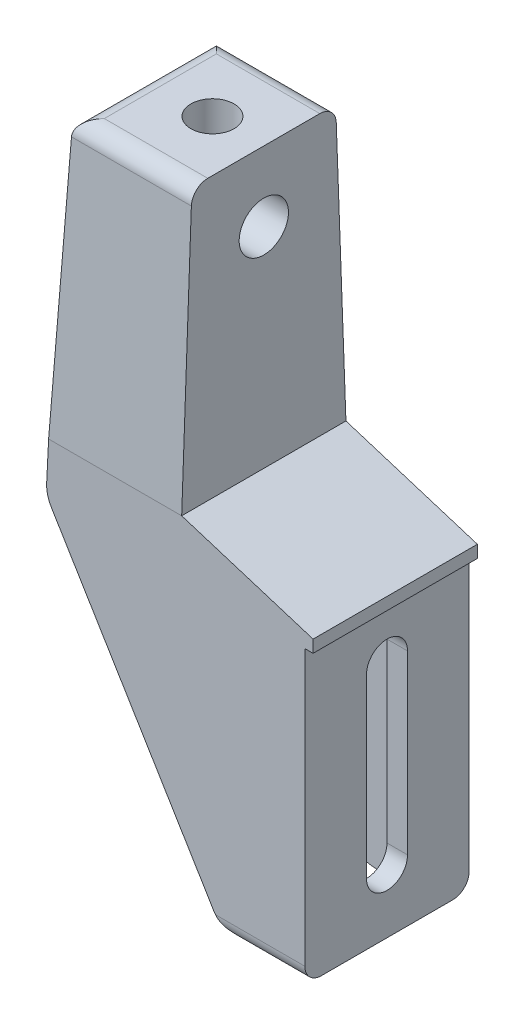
from build123d import *

# Parameters (mm, degrees)
EXTRUSION1_DEPTH        = 100
ESQUISSE2_R             = 6
EXTRUSION2_DEPTH        = 200
ESQUISSE4_OUTSIDE_W     = 116.682
ESQUISSE4_OUTSIDE_H     = 95.182
ENL_V_MAT_EXTRU_2_DEPTH = 18
ESQUISSE5_OUTSIDE_W     = 109.816
ESQUISSE5_OUTSIDE_H     = 84.374
ESQUISSE5_OUTSIDE_R     = 11.5
ENL_V_MAT_EXTRU_3_DEPTH = 18
ESQUISSE6_OUTSIDE_W     = 109.816
ESQUISSE6_OUTSIDE_H     = 84.374
ENL_V_MAT_EXTRU_4_DEPTH = 9.5
EXTRUSION3_DEPTH        = 100
EXTRUSION4_DEPTH        = 100
ESQUISSE10_W            = 50
ESQUISSE10_H            = 50
ENL_V_MAT_EXTRU_5_DEPTH = 213.264402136
ESQUISSE11_R            = 5.25
ENL_V_MAT_EXTRU_6_DEPTH = 20


with BuildPart() as part:
    # Esquisse1 → Extrusion1 (new body)
    with BuildSketch(Plane.XY):
        with BuildLine():
            Line((13.5, 197.5), (0, 193))
            Line((0, 193), (0, 184))
            Line((0, 184), (13.5, 179.5))
            Line((13.5, 179.5), (13.5, 161.5))
            Line((13.5, 161.5), (15.5, 161.5))
            Line((15.5, 161.5), (15.5, 152))
            Line((15.5, 152), (14.304996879, 152))
            ThreePointArc((14.304996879, 152), (11.548096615, 150.898189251), (10.309987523, 148.199750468))
            Line((10.309987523, 148.199750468), (6.622379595, 74.447591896))
            ThreePointArc((6.622379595, 74.447591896), (6.855776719, 72.08982092), (7.769521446, 69.903813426))
            Line((7.769521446, 69.903813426), (47.29936656, 4.633604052))
            ThreePointArc((47.29936656, 4.633604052), (50.042189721, 1.908415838), (53.742742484, 0.787862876))
            Line((53.742742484, 0.787862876), (69.5, 0))
            Line((69.5, 0), (69.5, 71))
            Line((69.5, 71), (71.5, 71))
            Line((71.5, 71), (71.5, 74))
            Line((71.5, 74), (39.5, 84))
            Line((39.5, 84), (39.5, 152))
            Line((39.5, 152), (34.5, 152))
            Line((34.5, 152), (34.5, 161.5))
            Line((34.5, 161.5), (36.5, 161.5))
            Line((36.5, 161.5), (36.5, 179.5))
            Line((36.5, 179.5), (50, 184))
            Line((50, 184), (50, 193))
            Line((50, 193), (36.5, 197.5))
            Line((36.5, 197.5), (13.5, 197.5))
        make_face()
    extrude(amount=-EXTRUSION1_DEPTH)


with BuildPart() as body_2:
    # Esquisse2 → Extrusion2 (new body)
    with BuildSketch(Plane(origin=(0, 0, 0), x_dir=(0, 0, -1), z_dir=(1, 0, 0))):
        with BuildLine():
            Line((15.5, 161.5), (13.5, 161.5))
            Line((13.5, 161.5), (13.5, 179.5))
            Line((13.5, 179.5), (0, 184))
            Line((0, 184), (0, 193))
            Line((0, 193), (13.5, 197.5))
            Line((13.5, 197.5), (36.5, 197.5))
            Line((36.5, 197.5), (50, 193))
            Line((50, 193), (50, 184))
            Line((50, 184), (36.5, 179.5))
            Line((36.5, 179.5), (36.5, 161.5))
            Line((36.5, 161.5), (34.5, 161.5))
            Line((34.5, 161.5), (34.5, 152))
            Line((34.5, 152), (38.644356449, 152))
            ThreePointArc((38.644356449, 152), (41.420339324, 150.879916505), (42.641655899, 148.146959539))
            Line((42.641655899, 148.146959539), (45, 84))
            Line((45, 84), (45, 4))
            ThreePointArc((45, 4), (43.828427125, 1.171572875), (41, 0))
            Line((41, 0), (9, 0))
            ThreePointArc((9, 0), (6.171572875, 1.171572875), (5, 4))
            Line((5, 4), (5, 84))
            Line((5, 84), (7.358344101, 148.146959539))
            ThreePointArc((7.358344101, 148.146959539), (8.579660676, 150.879916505), (11.355643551, 152))
            Line((11.355643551, 152), (15.5, 152))
            Line((15.5, 152), (15.5, 161.5))
        make_face()
        with Locations((25, 135)):
            Circle(ESQUISSE2_R, mode=Mode.SUBTRACT)
        with BuildLine():
            Line((30, 15), (30, 58))
            ThreePointArc((30, 58), (25, 63), (20, 58))
            Line((20, 58), (20, 15))
            ThreePointArc((20, 15), (25, 10), (30, 15))
        make_face(mode=Mode.SUBTRACT)
    extrude(amount=EXTRUSION2_DEPTH)


with BuildPart() as part_1:
    add(part.part)

    # Combiner1: intersect body 2
    add(body_2.part, mode=Mode.INTERSECT)

    # Esquisse4 outside → Enl_v. mat.-Extru.2 (cut)
    with BuildSketch(Plane(origin=(0, 197.5, 0), x_dir=(-1, 0, 0), z_dir=(0, 1, 0))):
        with Locations((-35.75, -25)):
            Rectangle(ESQUISSE4_OUTSIDE_W, ESQUISSE4_OUTSIDE_H)
        with BuildLine():
            ThreePointArc((-39.140914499, -6.643356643), (-40.512431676, -6.058145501), (-41.907615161, -6.584448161))
            ThreePointArc((-41.907615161, -6.584448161), (-42.67766953, -7.32233047), (-43.415551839, -8.092384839))
            ThreePointArc((-43.415551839, -8.092384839), (-43.941854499, -9.487568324), (-43.356643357, -10.859085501))
            ThreePointArc((-43.356643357, -10.859085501), (-37.5, -25), (-43.356643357, -39.140914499))
            ThreePointArc((-43.356643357, -39.140914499), (-43.941854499, -40.512431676), (-43.415551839, -41.907615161))
            ThreePointArc((-43.415551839, -41.907615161), (-42.67766953, -42.67766953), (-41.907615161, -43.415551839))
            ThreePointArc((-41.907615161, -43.415551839), (-40.512431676, -43.941854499), (-39.140914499, -43.356643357))
            ThreePointArc((-39.140914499, -43.356643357), (-25, -37.5), (-10.859085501, -43.356643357))
            ThreePointArc((-10.859085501, -43.356643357), (-9.487568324, -43.941854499), (-8.092384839, -43.415551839))
            ThreePointArc((-8.092384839, -43.415551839), (-7.32233047, -42.67766953), (-6.584448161, -41.907615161))
            ThreePointArc((-6.584448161, -41.907615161), (-6.058145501, -40.512431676), (-6.643356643, -39.140914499))
            ThreePointArc((-6.643356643, -39.140914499), (-12.5, -25), (-6.643356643, -10.859085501))
            ThreePointArc((-6.643356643, -10.859085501), (-6.058145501, -9.487568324), (-6.584448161, -8.092384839))
            ThreePointArc((-6.584448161, -8.092384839), (-7.32233047, -7.32233047), (-8.092384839, -6.584448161))
            ThreePointArc((-8.092384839, -6.584448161), (-9.487568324, -6.058145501), (-10.859085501, -6.643356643))
            ThreePointArc((-10.859085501, -6.643356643), (-25, -12.5), (-39.140914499, -6.643356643))
        make_face(mode=Mode.SUBTRACT)
    extrude(amount=-ENL_V_MAT_EXTRU_2_DEPTH, mode=Mode.SUBTRACT)

    # Esquisse5 outside → Enl_v. mat.-Extru.3 (cut)
    with BuildSketch(Plane.XZ.offset(-161.5)):
        with Locations((38.779, -25)):
            Rectangle(ESQUISSE5_OUTSIDE_W, ESQUISSE5_OUTSIDE_H)
        with Locations(Location((25, -25, 0), (0, 0, 270))):
            Circle(ESQUISSE5_OUTSIDE_R, mode=Mode.SUBTRACT)
    extrude(amount=-ENL_V_MAT_EXTRU_3_DEPTH, mode=Mode.SUBTRACT)

    # Esquisse6 outside → Enl_v. mat.-Extru.4 (cut)
    with BuildSketch(Plane(origin=(0, 152, 0), x_dir=(-1, 0, 0), z_dir=(0, 1, 0))):
        with Locations((-38.779, -25)):
            Rectangle(ESQUISSE6_OUTSIDE_W, ESQUISSE6_OUTSIDE_H)
        Polygon((-19.480084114, -34.504927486), (-14, -25), (-19.488621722, -15.5), (-30.460174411, -15.5), (-35.94310095, -25.009857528), (-30.457327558, -34.504927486), align=None, mode=Mode.SUBTRACT)
    extrude(amount=ENL_V_MAT_EXTRU_4_DEPTH, mode=Mode.SUBTRACT)


with BuildPart() as body_2_2:
    # Esquisse9 → Extrusion3 (new body)
    with BuildSketch(Plane.XY):
        Polygon((64.5, -11.562735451), (64.5, 70.949045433), (34.5, 80.324045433), (34.5, 143.146959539), (-50.277504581, 143.146959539), (-50.277504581, -11.562735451), align=None)
    extrude(amount=-EXTRUSION3_DEPTH)


with BuildPart() as body_3:
    # Esquisse8 → Extrusion4 (new body)
    with BuildSketch(Plane(origin=(0, 0, 0), x_dir=(0, 0, -1), z_dir=(1, 0, 0))):
        Polygon((37.5, 120), (12.5, 120), (12.5, 0), (37.5, -0.307979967), align=None)
    extrude(amount=EXTRUSION4_DEPTH)


with BuildPart() as body_2_2_1:
    add(body_2_2.part)

    # Combiner2: intersect body 3
    add(body_3.part, mode=Mode.INTERSECT)


with BuildPart() as part_2:
    add(part_1.part)

    # Combiner4: cut body 2 2
    add(body_2_2_1.part, mode=Mode.SUBTRACT)

    # Esquisse10 → Enl_v. mat.-Extru.5 (cut, through all)
    with BuildSketch(Plane(origin=(69.5, 0, 0), x_dir=(0, 0, -1), z_dir=(1, 0, 0))):
        with Locations((25, 177)):
            Rectangle(ESQUISSE10_W, ESQUISSE10_H)
    extrude(amount=-ENL_V_MAT_EXTRU_5_DEPTH, mode=Mode.SUBTRACT)

    # Esquisse11 → Enl_v. mat.-Extru.6 (cut)
    with BuildSketch(Plane(origin=(0, 152, 0), x_dir=(-1, 0, 0), z_dir=(0, 1, 0))):
        with Locations(Location((-27, -25, 0), (0, 0, 90))):
            Circle(ESQUISSE11_R)
    extrude(amount=-ENL_V_MAT_EXTRU_6_DEPTH, mode=Mode.SUBTRACT)


solid = part_2.part
